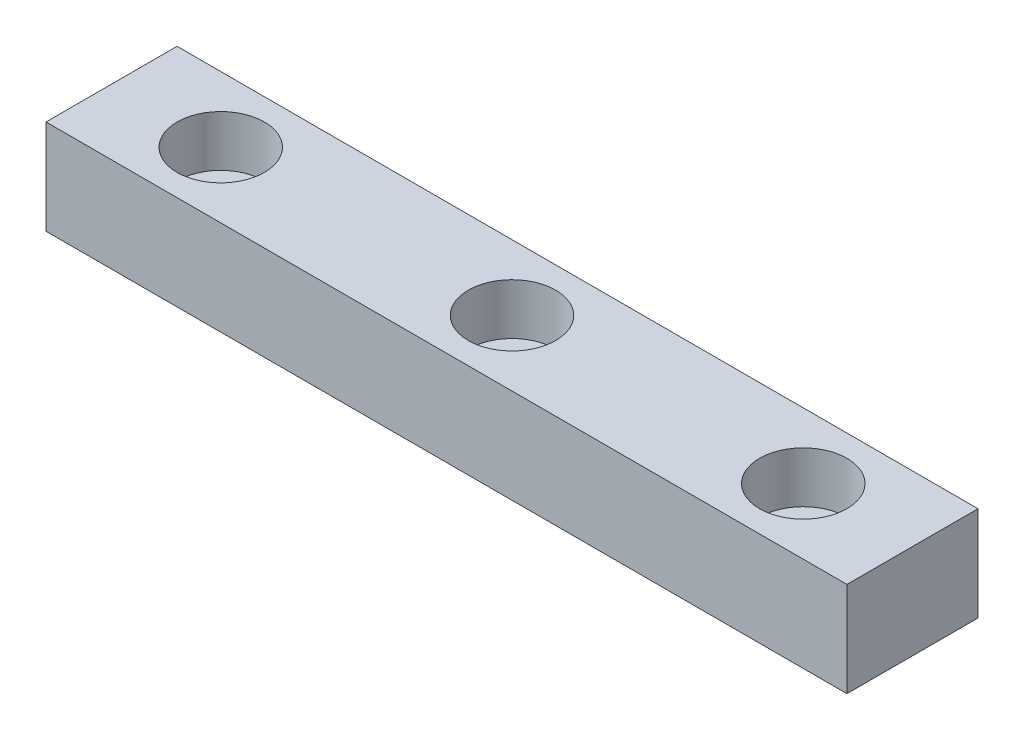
ISO-10303-21;
HEADER;
FILE_DESCRIPTION(('STEP AP214'),'2;1');
FILE_NAME('part.step','',(''),(''),'','','');
FILE_SCHEMA(('AUTOMOTIVE_DESIGN { 1 0 10303 214 1 1 1 1 }'));
ENDSEC;
DATA;
#1=APPLICATION_CONTEXT('core data for automotive mechanical design processes');
#2=APPLICATION_PROTOCOL_DEFINITION('international standard','automotive_design',2000,#1);
#3=PRODUCT_CONTEXT('',#1,'mechanical');
#4=PRODUCT('Part','Part','',(#3));
#5=PRODUCT_RELATED_PRODUCT_CATEGORY('part','',(#4));
#6=PRODUCT_DEFINITION_FORMATION('','',#4);
#7=PRODUCT_DEFINITION_CONTEXT('part definition',#1,'design');
#8=PRODUCT_DEFINITION('design','',#6,#7);
#9=PRODUCT_DEFINITION_SHAPE('','',#8);
#10=(LENGTH_UNIT() NAMED_UNIT(*) SI_UNIT(.MILLI.,.METRE.));
#11=(NAMED_UNIT(*) PLANE_ANGLE_UNIT() SI_UNIT($,.RADIAN.));
#12=(NAMED_UNIT(*) SI_UNIT($,.STERADIAN.) SOLID_ANGLE_UNIT());
#13=UNCERTAINTY_MEASURE_WITH_UNIT(LENGTH_MEASURE(1.E-05),#10,'distance_accuracy_value','');
#14=(GEOMETRIC_REPRESENTATION_CONTEXT(3) GLOBAL_UNCERTAINTY_ASSIGNED_CONTEXT((#13)) GLOBAL_UNIT_ASSIGNED_CONTEXT((#10,
#11,#12)) REPRESENTATION_CONTEXT('',''));
#15=CARTESIAN_POINT('',(0.,0.,0.));
#16=DIRECTION('',(0.,0.,1.));
#17=DIRECTION('',(1.,0.,0.));
#18=AXIS2_PLACEMENT_3D('',#15,#16,#17);
#19=CARTESIAN_POINT('',(7.5,-2.5,4.5));
#20=DIRECTION('',(0.,1.,0.));
#21=DIRECTION('',(0.,0.,1.));
#22=AXIS2_PLACEMENT_3D('',#19,#20,#21);
#23=CYLINDRICAL_SURFACE('',#22,1.75);
#24=CARTESIAN_POINT('',(7.5,0.,4.5));
#25=DIRECTION('',(0.,1.,0.));
#26=DIRECTION('',(0.,0.,1.));
#27=AXIS2_PLACEMENT_3D('',#24,#25,#26);
#28=CIRCLE('',#27,1.75);
#29=CARTESIAN_POINT('',(7.5,0.,6.25));
#30=VERTEX_POINT('',#29);
#31=EDGE_CURVE('E102',#30,#30,#28,.T.);
#32=ORIENTED_EDGE('',*,*,#31,.F.);
#33=EDGE_LOOP('',(#32));
#34=FACE_BOUND('',#33,.T.);
#35=CARTESIAN_POINT('',(7.5,3.,4.5));
#36=DIRECTION('',(0.,1.,0.));
#37=DIRECTION('',(0.,0.,1.));
#38=AXIS2_PLACEMENT_3D('',#35,#36,#37);
#39=CIRCLE('',#38,1.75);
#40=CARTESIAN_POINT('',(7.5,3.,6.25));
#41=VERTEX_POINT('',#40);
#42=EDGE_CURVE('E36',#41,#41,#39,.F.);
#43=ORIENTED_EDGE('',*,*,#42,.F.);
#44=EDGE_LOOP('',(#43));
#45=FACE_BOUND('',#44,.T.);
#46=ADVANCED_FACE('F32',(#34,#45),#23,.F.);
#47=CARTESIAN_POINT('',(27.5,-2.5,4.5));
#48=DIRECTION('',(0.,1.,0.));
#49=DIRECTION('',(0.,0.,1.));
#50=AXIS2_PLACEMENT_3D('',#47,#48,#49);
#51=CYLINDRICAL_SURFACE('',#50,1.75);
#52=CARTESIAN_POINT('',(27.5,0.,4.5));
#53=DIRECTION('',(0.,1.,0.));
#54=DIRECTION('',(0.,0.,1.));
#55=AXIS2_PLACEMENT_3D('',#52,#53,#54);
#56=CIRCLE('',#55,1.75);
#57=CARTESIAN_POINT('',(27.5,0.,6.25));
#58=VERTEX_POINT('',#57);
#59=EDGE_CURVE('E135',#58,#58,#56,.T.);
#60=ORIENTED_EDGE('',*,*,#59,.F.);
#61=EDGE_LOOP('',(#60));
#62=FACE_BOUND('',#61,.T.);
#63=CARTESIAN_POINT('',(27.5,3.,4.5));
#64=DIRECTION('',(0.,1.,0.));
#65=DIRECTION('',(0.,0.,1.));
#66=AXIS2_PLACEMENT_3D('',#63,#64,#65);
#67=CIRCLE('',#66,1.75);
#68=CARTESIAN_POINT('',(27.5,3.,6.25));
#69=VERTEX_POINT('',#68);
#70=EDGE_CURVE('E112',#69,#69,#67,.F.);
#71=ORIENTED_EDGE('',*,*,#70,.F.);
#72=EDGE_LOOP('',(#71));
#73=FACE_BOUND('',#72,.T.);
#74=ADVANCED_FACE('F144',(#62,#73),#51,.F.);
#75=CARTESIAN_POINT('',(47.5,-2.5,4.5));
#76=DIRECTION('',(0.,1.,0.));
#77=DIRECTION('',(0.,0.,1.));
#78=AXIS2_PLACEMENT_3D('',#75,#76,#77);
#79=CYLINDRICAL_SURFACE('',#78,1.75);
#80=CARTESIAN_POINT('',(47.5,0.,4.5));
#81=DIRECTION('',(0.,1.,0.));
#82=DIRECTION('',(0.,0.,1.));
#83=AXIS2_PLACEMENT_3D('',#80,#81,#82);
#84=CIRCLE('',#83,1.75);
#85=CARTESIAN_POINT('',(47.5,0.,6.25));
#86=VERTEX_POINT('',#85);
#87=EDGE_CURVE('E110',#86,#86,#84,.T.);
#88=ORIENTED_EDGE('',*,*,#87,.F.);
#89=EDGE_LOOP('',(#88));
#90=FACE_BOUND('',#89,.T.);
#91=CARTESIAN_POINT('',(47.5,3.,4.5));
#92=DIRECTION('',(0.,1.,0.));
#93=DIRECTION('',(0.,0.,1.));
#94=AXIS2_PLACEMENT_3D('',#91,#92,#93);
#95=CIRCLE('',#94,1.75);
#96=CARTESIAN_POINT('',(47.5,3.,6.25));
#97=VERTEX_POINT('',#96);
#98=EDGE_CURVE('E108',#97,#97,#95,.F.);
#99=ORIENTED_EDGE('',*,*,#98,.F.);
#100=EDGE_LOOP('',(#99));
#101=FACE_BOUND('',#100,.T.);
#102=ADVANCED_FACE('F184',(#90,#101),#79,.F.);
#103=CARTESIAN_POINT('',(0.,0.,9.));
#104=DIRECTION('',(1.,0.,0.));
#105=DIRECTION('',(0.,0.,-1.));
#106=AXIS2_PLACEMENT_3D('',#103,#104,#105);
#107=PLANE('',#106);
#108=DIRECTION('',(0.,-1.,0.));
#109=VECTOR('',#108,1.);
#110=CARTESIAN_POINT('',(0.,0.,0.));
#111=LINE('',#110,#109);
#112=CARTESIAN_POINT('',(0.,6.5,0.));
#113=VERTEX_POINT('',#112);
#114=CARTESIAN_POINT('',(0.,0.,0.));
#115=VERTEX_POINT('',#114);
#116=EDGE_CURVE('E99',#113,#115,#111,.T.);
#117=ORIENTED_EDGE('',*,*,#116,.T.);
#118=DIRECTION('',(0.,0.,-1.));
#119=VECTOR('',#118,1.);
#120=CARTESIAN_POINT('',(0.,0.,9.));
#121=LINE('',#120,#119);
#122=CARTESIAN_POINT('',(0.,0.,9.));
#123=VERTEX_POINT('',#122);
#124=EDGE_CURVE('E11',#123,#115,#121,.T.);
#125=ORIENTED_EDGE('',*,*,#124,.F.);
#126=DIRECTION('',(0.,-1.,0.));
#127=VECTOR('',#126,1.);
#128=CARTESIAN_POINT('',(0.,0.,9.));
#129=LINE('',#128,#127);
#130=CARTESIAN_POINT('',(0.,6.5,9.));
#131=VERTEX_POINT('',#130);
#132=EDGE_CURVE('E86',#131,#123,#129,.T.);
#133=ORIENTED_EDGE('',*,*,#132,.F.);
#134=DIRECTION('',(0.,0.,-1.));
#135=VECTOR('',#134,1.);
#136=CARTESIAN_POINT('',(0.,6.5,9.));
#137=LINE('',#136,#135);
#138=EDGE_CURVE('E95',#131,#113,#137,.T.);
#139=ORIENTED_EDGE('',*,*,#138,.T.);
#140=EDGE_LOOP('',(#117,#125,#133,#139));
#141=FACE_BOUND('',#140,.T.);
#142=ADVANCED_FACE('F34',(#141),#107,.F.);
#143=CARTESIAN_POINT('',(0.,0.,9.));
#144=DIRECTION('',(0.,1.,0.));
#145=DIRECTION('',(0.,0.,1.));
#146=AXIS2_PLACEMENT_3D('',#143,#144,#145);
#147=PLANE('',#146);
#148=ORIENTED_EDGE('',*,*,#87,.T.);
#149=EDGE_LOOP('',(#148));
#150=FACE_BOUND('',#149,.T.);
#151=ORIENTED_EDGE('',*,*,#59,.T.);
#152=EDGE_LOOP('',(#151));
#153=FACE_BOUND('',#152,.T.);
#154=ORIENTED_EDGE('',*,*,#31,.T.);
#155=EDGE_LOOP('',(#154));
#156=FACE_BOUND('',#155,.T.);
#157=DIRECTION('',(1.,0.,0.));
#158=VECTOR('',#157,1.);
#159=CARTESIAN_POINT('',(0.,0.,0.));
#160=LINE('',#159,#158);
#161=CARTESIAN_POINT('',(55.,0.,0.));
#162=VERTEX_POINT('',#161);
#163=EDGE_CURVE('E90',#115,#162,#160,.T.);
#164=ORIENTED_EDGE('',*,*,#163,.T.);
#165=DIRECTION('',(0.,0.,-1.));
#166=VECTOR('',#165,1.);
#167=CARTESIAN_POINT('',(55.,0.,9.));
#168=LINE('',#167,#166);
#169=CARTESIAN_POINT('',(55.,0.,9.));
#170=VERTEX_POINT('',#169);
#171=EDGE_CURVE('E42',#170,#162,#168,.T.);
#172=ORIENTED_EDGE('',*,*,#171,.F.);
#173=DIRECTION('',(1.,0.,0.));
#174=VECTOR('',#173,1.);
#175=CARTESIAN_POINT('',(0.,0.,9.));
#176=LINE('',#175,#174);
#177=EDGE_CURVE('E81',#123,#170,#176,.T.);
#178=ORIENTED_EDGE('',*,*,#177,.F.);
#179=ORIENTED_EDGE('',*,*,#124,.T.);
#180=EDGE_LOOP('',(#164,#172,#178,#179));
#181=FACE_BOUND('',#180,.T.);
#182=ADVANCED_FACE('F89',(#150,#153,#156,#181),#147,.F.);
#183=CARTESIAN_POINT('',(55.,0.,9.));
#184=DIRECTION('',(-1.,0.,0.));
#185=DIRECTION('',(0.,0.,1.));
#186=AXIS2_PLACEMENT_3D('',#183,#184,#185);
#187=PLANE('',#186);
#188=DIRECTION('',(0.,1.,0.));
#189=VECTOR('',#188,1.);
#190=CARTESIAN_POINT('',(55.,0.,0.));
#191=LINE('',#190,#189);
#192=CARTESIAN_POINT('',(55.,6.5,0.));
#193=VERTEX_POINT('',#192);
#194=EDGE_CURVE('E68',#162,#193,#191,.T.);
#195=ORIENTED_EDGE('',*,*,#194,.T.);
#196=DIRECTION('',(0.,0.,-1.));
#197=VECTOR('',#196,1.);
#198=CARTESIAN_POINT('',(55.,6.5,9.));
#199=LINE('',#198,#197);
#200=CARTESIAN_POINT('',(55.,6.5,9.));
#201=VERTEX_POINT('',#200);
#202=EDGE_CURVE('E91',#201,#193,#199,.T.);
#203=ORIENTED_EDGE('',*,*,#202,.F.);
#204=DIRECTION('',(0.,1.,0.));
#205=VECTOR('',#204,1.);
#206=CARTESIAN_POINT('',(55.,0.,9.));
#207=LINE('',#206,#205);
#208=EDGE_CURVE('E84',#170,#201,#207,.T.);
#209=ORIENTED_EDGE('',*,*,#208,.F.);
#210=ORIENTED_EDGE('',*,*,#171,.T.);
#211=EDGE_LOOP('',(#195,#203,#209,#210));
#212=FACE_BOUND('',#211,.T.);
#213=ADVANCED_FACE('F93',(#212),#187,.F.);
#214=CARTESIAN_POINT('',(0.,6.5,9.));
#215=DIRECTION('',(0.,-1.,0.));
#216=DIRECTION('',(0.,0.,-1.));
#217=AXIS2_PLACEMENT_3D('',#214,#215,#216);
#218=PLANE('',#217);
#219=CARTESIAN_POINT('',(7.5,6.5,4.5));
#220=DIRECTION('',(0.,1.,0.));
#221=DIRECTION('',(0.,0.,1.));
#222=AXIS2_PLACEMENT_3D('',#219,#220,#221);
#223=CIRCLE('',#222,3.);
#224=CARTESIAN_POINT('',(7.5,6.5,7.5));
#225=VERTEX_POINT('',#224);
#226=EDGE_CURVE('E128',#225,#225,#223,.T.);
#227=ORIENTED_EDGE('',*,*,#226,.F.);
#228=EDGE_LOOP('',(#227));
#229=FACE_BOUND('',#228,.T.);
#230=CARTESIAN_POINT('',(27.5,6.5,4.5));
#231=DIRECTION('',(0.,1.,0.));
#232=DIRECTION('',(0.,0.,1.));
#233=AXIS2_PLACEMENT_3D('',#230,#231,#232);
#234=CIRCLE('',#233,3.);
#235=CARTESIAN_POINT('',(27.5,6.5,7.5));
#236=VERTEX_POINT('',#235);
#237=EDGE_CURVE('E121',#236,#236,#234,.T.);
#238=ORIENTED_EDGE('',*,*,#237,.F.);
#239=EDGE_LOOP('',(#238));
#240=FACE_BOUND('',#239,.T.);
#241=CARTESIAN_POINT('',(47.5,6.5,4.5));
#242=DIRECTION('',(0.,1.,0.));
#243=DIRECTION('',(0.,0.,1.));
#244=AXIS2_PLACEMENT_3D('',#241,#242,#243);
#245=CIRCLE('',#244,3.);
#246=CARTESIAN_POINT('',(47.5,6.5,7.5));
#247=VERTEX_POINT('',#246);
#248=EDGE_CURVE('E114',#247,#247,#245,.T.);
#249=ORIENTED_EDGE('',*,*,#248,.F.);
#250=EDGE_LOOP('',(#249));
#251=FACE_BOUND('',#250,.T.);
#252=DIRECTION('',(-1.,0.,0.));
#253=VECTOR('',#252,1.);
#254=CARTESIAN_POINT('',(0.,6.5,0.));
#255=LINE('',#254,#253);
#256=EDGE_CURVE('E74',#193,#113,#255,.T.);
#257=ORIENTED_EDGE('',*,*,#256,.T.);
#258=ORIENTED_EDGE('',*,*,#138,.F.);
#259=DIRECTION('',(-1.,0.,0.));
#260=VECTOR('',#259,1.);
#261=CARTESIAN_POINT('',(0.,6.5,9.));
#262=LINE('',#261,#260);
#263=EDGE_CURVE('E51',#201,#131,#262,.T.);
#264=ORIENTED_EDGE('',*,*,#263,.F.);
#265=ORIENTED_EDGE('',*,*,#202,.T.);
#266=EDGE_LOOP('',(#257,#258,#264,#265));
#267=FACE_BOUND('',#266,.T.);
#268=ADVANCED_FACE('F158',(#229,#240,#251,#267),#218,.F.);
#269=CARTESIAN_POINT('',(0.,6.5,9.));
#270=DIRECTION('',(0.,0.,-1.));
#271=DIRECTION('',(-1.,0.,0.));
#272=AXIS2_PLACEMENT_3D('',#269,#270,#271);
#273=PLANE('',#272);
#274=ORIENTED_EDGE('',*,*,#132,.T.);
#275=ORIENTED_EDGE('',*,*,#177,.T.);
#276=ORIENTED_EDGE('',*,*,#208,.T.);
#277=ORIENTED_EDGE('',*,*,#263,.T.);
#278=EDGE_LOOP('',(#274,#275,#276,#277));
#279=FACE_BOUND('',#278,.T.);
#280=ADVANCED_FACE('F82',(#279),#273,.F.);
#281=CARTESIAN_POINT('',(0.,6.5,0.));
#282=DIRECTION('',(0.,0.,-1.));
#283=DIRECTION('',(-1.,0.,0.));
#284=AXIS2_PLACEMENT_3D('',#281,#282,#283);
#285=PLANE('',#284);
#286=ORIENTED_EDGE('',*,*,#116,.F.);
#287=ORIENTED_EDGE('',*,*,#256,.F.);
#288=ORIENTED_EDGE('',*,*,#194,.F.);
#289=ORIENTED_EDGE('',*,*,#163,.F.);
#290=EDGE_LOOP('',(#286,#287,#288,#289));
#291=FACE_BOUND('',#290,.T.);
#292=ADVANCED_FACE('F178',(#291),#285,.T.);
#293=CARTESIAN_POINT('',(47.5,3.,4.5));
#294=DIRECTION('',(0.,1.,0.));
#295=DIRECTION('',(0.,0.,1.));
#296=AXIS2_PLACEMENT_3D('',#293,#294,#295);
#297=PLANE('',#296);
#298=CARTESIAN_POINT('',(47.5,3.,4.5));
#299=DIRECTION('',(0.,1.,0.));
#300=DIRECTION('',(0.,0.,1.));
#301=AXIS2_PLACEMENT_3D('',#298,#299,#300);
#302=CIRCLE('',#301,3.);
#303=CARTESIAN_POINT('',(47.5,3.,7.5));
#304=VERTEX_POINT('',#303);
#305=EDGE_CURVE('E111',#304,#304,#302,.T.);
#306=ORIENTED_EDGE('',*,*,#305,.T.);
#307=EDGE_LOOP('',(#306));
#308=FACE_BOUND('',#307,.T.);
#309=ORIENTED_EDGE('',*,*,#98,.T.);
#310=EDGE_LOOP('',(#309));
#311=FACE_BOUND('',#310,.T.);
#312=ADVANCED_FACE('F169',(#308,#311),#297,.T.);
#313=CARTESIAN_POINT('',(47.5,3.,4.5));
#314=DIRECTION('',(0.,1.,0.));
#315=DIRECTION('',(0.,0.,1.));
#316=AXIS2_PLACEMENT_3D('',#313,#314,#315);
#317=CYLINDRICAL_SURFACE('',#316,3.);
#318=ORIENTED_EDGE('',*,*,#305,.F.);
#319=EDGE_LOOP('',(#318));
#320=FACE_BOUND('',#319,.T.);
#321=ORIENTED_EDGE('',*,*,#248,.T.);
#322=EDGE_LOOP('',(#321));
#323=FACE_BOUND('',#322,.T.);
#324=ADVANCED_FACE('F166',(#320,#323),#317,.F.);
#325=CARTESIAN_POINT('',(27.5,3.,4.5));
#326=DIRECTION('',(0.,1.,0.));
#327=DIRECTION('',(0.,0.,1.));
#328=AXIS2_PLACEMENT_3D('',#325,#326,#327);
#329=PLANE('',#328);
#330=CARTESIAN_POINT('',(27.5,3.,4.5));
#331=DIRECTION('',(0.,1.,0.));
#332=DIRECTION('',(0.,0.,1.));
#333=AXIS2_PLACEMENT_3D('',#330,#331,#332);
#334=CIRCLE('',#333,3.);
#335=CARTESIAN_POINT('',(27.5,3.,7.5));
#336=VERTEX_POINT('',#335);
#337=EDGE_CURVE('E115',#336,#336,#334,.T.);
#338=ORIENTED_EDGE('',*,*,#337,.T.);
#339=EDGE_LOOP('',(#338));
#340=FACE_BOUND('',#339,.T.);
#341=ORIENTED_EDGE('',*,*,#70,.T.);
#342=EDGE_LOOP('',(#341));
#343=FACE_BOUND('',#342,.T.);
#344=ADVANCED_FACE('F168',(#340,#343),#329,.T.);
#345=CARTESIAN_POINT('',(27.5,3.,4.5));
#346=DIRECTION('',(0.,1.,0.));
#347=DIRECTION('',(0.,0.,1.));
#348=AXIS2_PLACEMENT_3D('',#345,#346,#347);
#349=CYLINDRICAL_SURFACE('',#348,3.);
#350=ORIENTED_EDGE('',*,*,#337,.F.);
#351=EDGE_LOOP('',(#350));
#352=FACE_BOUND('',#351,.T.);
#353=ORIENTED_EDGE('',*,*,#237,.T.);
#354=EDGE_LOOP('',(#353));
#355=FACE_BOUND('',#354,.T.);
#356=ADVANCED_FACE('F176',(#352,#355),#349,.F.);
#357=CARTESIAN_POINT('',(7.5,3.,4.5));
#358=DIRECTION('',(0.,1.,0.));
#359=DIRECTION('',(0.,0.,1.));
#360=AXIS2_PLACEMENT_3D('',#357,#358,#359);
#361=PLANE('',#360);
#362=CARTESIAN_POINT('',(7.5,3.,4.5));
#363=DIRECTION('',(0.,1.,0.));
#364=DIRECTION('',(0.,0.,1.));
#365=AXIS2_PLACEMENT_3D('',#362,#363,#364);
#366=CIRCLE('',#365,3.);
#367=CARTESIAN_POINT('',(7.5,3.,7.5));
#368=VERTEX_POINT('',#367);
#369=EDGE_CURVE('E149',#368,#368,#366,.T.);
#370=ORIENTED_EDGE('',*,*,#369,.T.);
#371=EDGE_LOOP('',(#370));
#372=FACE_BOUND('',#371,.T.);
#373=ORIENTED_EDGE('',*,*,#42,.T.);
#374=EDGE_LOOP('',(#373));
#375=FACE_BOUND('',#374,.T.);
#376=ADVANCED_FACE('F278',(#372,#375),#361,.T.);
#377=CARTESIAN_POINT('',(7.5,3.,4.5));
#378=DIRECTION('',(0.,1.,0.));
#379=DIRECTION('',(0.,0.,1.));
#380=AXIS2_PLACEMENT_3D('',#377,#378,#379);
#381=CYLINDRICAL_SURFACE('',#380,3.);
#382=ORIENTED_EDGE('',*,*,#369,.F.);
#383=EDGE_LOOP('',(#382));
#384=FACE_BOUND('',#383,.T.);
#385=ORIENTED_EDGE('',*,*,#226,.T.);
#386=EDGE_LOOP('',(#385));
#387=FACE_BOUND('',#386,.T.);
#388=ADVANCED_FACE('F156',(#384,#387),#381,.F.);
#389=CLOSED_SHELL('',(#46,#74,#102,#142,#182,#213,#268,#280,#292,#312,#324,#344,#356,#376,#388));
#390=MANIFOLD_SOLID_BREP('B2',#389);
#391=ADVANCED_BREP_SHAPE_REPRESENTATION('',(#18,#390),#14);
#392=SHAPE_DEFINITION_REPRESENTATION(#9,#391);
ENDSEC;
END-ISO-10303-21;
